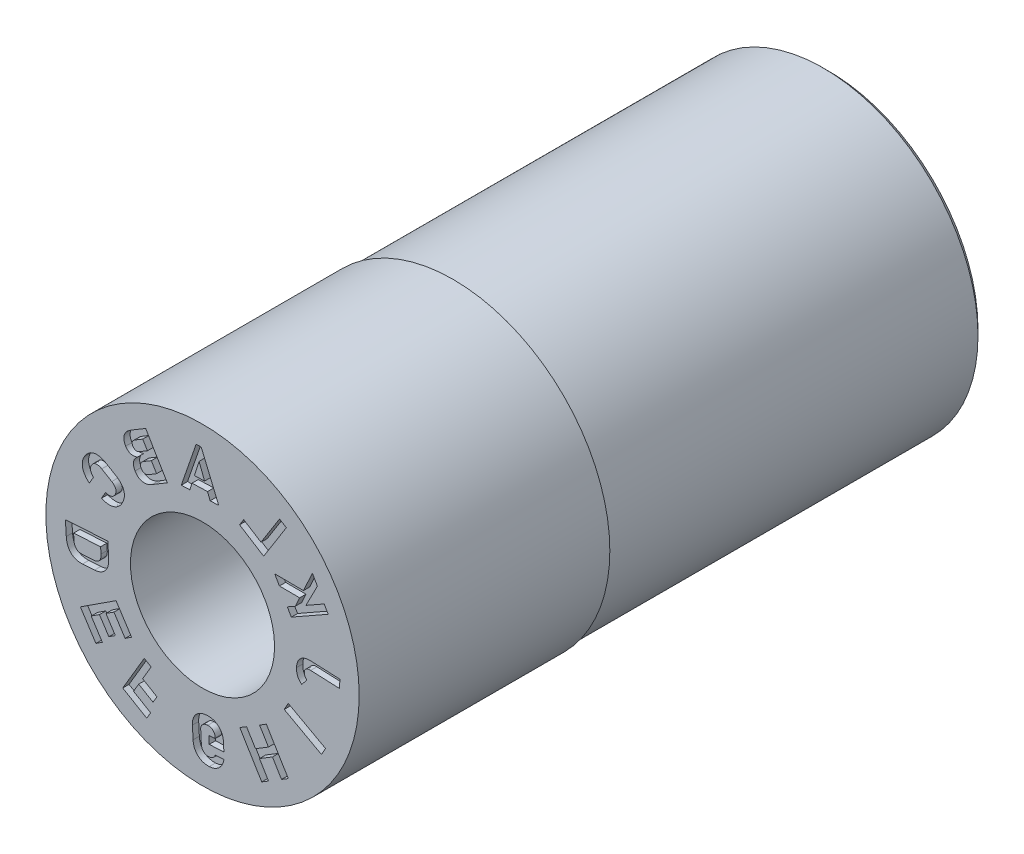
from build123d import *

# Parameters (mm, degrees)
SKETCH4_W          = 12
SKETCH4_H          = 1
CUT_EXTRUDE1_DEPTH = 0.2
CUT_EXTRUDE2_DEPTH = 2


with BuildPart() as part:
    # Sketch1 → Revolve1 (revolve)
    with BuildSketch(Plane(origin=(0, 0, 0), x_dir=(0, 0, -1), z_dir=(1, 0, 0)), mode=Mode.PRIVATE) as revolve1_sk:
        Polygon((0, 5), (0, 2.3), (4, 2.3), (4, 1.25), (16, 1.25), (16, 2.5), (20, 2.5), (20, 4.75), (19.75, 5), align=None)
    revolve(revolve1_sk.sketch.rotate(Axis((0, 0, 3.797909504), (0, 0, -1)), 90), axis=Axis((0, 0, 3.797909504), (0, 0, -1)))

    # Sketch4 → Cut-Revolve1 (revolve, cut)
    with BuildSketch(Plane(origin=(0, 0, 0), x_dir=(0, 0, -1), z_dir=(1, 0, 0)), mode=Mode.PRIVATE) as cut_revolve1_sk:
        with Locations((14, 5.435)):
            Rectangle(SKETCH4_W, SKETCH4_H)
    revolve(cut_revolve1_sk.sketch.rotate(Axis((0, 0, 0), (0, 0, -1)), 90), axis=Axis((0, 0, 0), (0, 0, -1)), mode=Mode.SUBTRACT)

    # Sketch2 → Cut-Extrude1 (cut)
    # profile 1 of 12: a face of its own
    with BuildSketch(Plane.XY):
        Polygon((3.30133436, 1.640264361), (3.666537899, 2.354151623), (3.508067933, 2.633202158), (3.220401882, 2.00838881), (2.304251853, 2.015537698), (2.453311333, 1.752407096), (3.101234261, 1.749555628), (2.962387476, 1.447979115), (2.70792278, 1.303620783), (2.833715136, 1.082062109), (4.009677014, 1.749187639), (3.883884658, 1.970746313), align=None)
    # profile 2 of 12: a face of its own
    with BuildSketch(Plane.XY):
        Polygon((2.674849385, 3.472904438), (2.458510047, 3.609103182), (1.866776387, 2.669286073), (1.313670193, 3.017419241), (1.182380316, 2.808827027), (1.951862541, 2.324625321), align=None)
    # profile 3 of 12: a face of its own
    with BuildSketch(Plane.XY):
        Polygon((-0.042748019, 4.346046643), (-0.204425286, 4.340760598), (-0.677793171, 2.972522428), (-0.403460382, 2.981399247), (-0.334589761, 3.200453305), (0.16055951, 3.21652421), (0.24353801, 3.002282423), (0.517595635, 3.011145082), align=None)
        Polygon((-0.109950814, 3.914953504), (0.066589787, 3.459144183), (-0.256554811, 3.448655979), align=None, mode=Mode.SUBTRACT)
    # profile 4 of 12: a face of its own
    with BuildSketch(Plane.XY):
        Polygon((-3.082276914, -1.775058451), (-2.826904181, -1.609171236), (-2.470700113, -2.157327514), (-2.26397346, -2.022961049), (-2.759498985, -1.259987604), (-3.898384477, -1.999794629), (-3.402858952, -2.762768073), (-3.196132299, -2.628401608), (-3.552263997, -2.080356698), (-3.289039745, -1.909369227), (-2.988825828, -2.371492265), (-2.782099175, -2.2371258), align=None)
    # profile 5 of 12: a face of its own
    with BuildSketch(Plane.XY):
        with BuildLine():
            Line((-2.170598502, 3.759586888), (-2.286163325, 3.690418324))
            add(Edge.make_bspline(
                [(-2.286163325, 3.690418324), (-2.320935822, 3.669517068), (-2.369336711, 3.63527044), (-2.423568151, 3.581302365), (-2.45572292, 3.539807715), (-2.481033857, 3.496598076), (-2.499164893, 3.451858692), (-2.510025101, 3.405746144), (-2.51313318, 3.358434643), (-2.509292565, 3.310289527), (-2.493373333, 3.243663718), (-2.470940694, 3.195922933), (-2.452625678, 3.165163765)],
                knots=[0, 0, 0, 0, 0.194845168, 0.282877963, 0.366288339, 0.446088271, 0.522464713, 0.597117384, 0.672448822, 0.749099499, 0.828057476, 1, 1, 1, 1], degree=3))
            add(Edge.make_bspline(
                [(-2.452625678, 3.165163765), (-2.439318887, 3.144239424), (-2.41826532, 3.113768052), (-2.382461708, 3.081447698), (-2.354615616, 3.061132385), (-2.324694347, 3.044996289), (-2.293150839, 3.032792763), (-2.259778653, 3.025473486), (-2.225085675, 3.021726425), (-2.189054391, 3.022551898), (-2.138248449, 3.029028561), (-2.100751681, 3.041189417), (-2.075727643, 3.050350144)],
                knots=[0, 0, 0, 0, 0.172363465, 0.253470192, 0.332877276, 0.410440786, 0.488121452, 0.566191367, 0.646247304, 0.729123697, 0.815081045, 1, 1, 1, 1], degree=3))
            add(Edge.make_bspline(
                [(-2.075727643, 3.050350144), (-2.097940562, 3.032740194), (-2.128281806, 3.003964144), (-2.160449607, 2.959963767), (-2.179347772, 2.926338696), (-2.193754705, 2.891474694), (-2.202594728, 2.855507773), (-2.207195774, 2.818881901), (-2.205957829, 2.781593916), (-2.20024065, 2.743889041), (-2.185203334, 2.692154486), (-2.167913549, 2.654610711), (-2.153058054, 2.630741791)],
                knots=[0, 0, 0, 0, 0.180211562, 0.263728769, 0.34541809, 0.424739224, 0.502578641, 0.580049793, 0.658505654, 0.738799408, 0.821729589, 1, 1, 1, 1], degree=3))
            Line((-2.153058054, 2.630741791), (-2.151552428, 2.628337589))
            add(Edge.make_bspline(
                [(-2.151552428, 2.628337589), (-2.132784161, 2.597601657), (-2.101427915, 2.554555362), (-2.04964288, 2.508804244), (-2.008730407, 2.482398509), (-1.965223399, 2.462764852), (-1.919273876, 2.450131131), (-1.871003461, 2.444897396), (-1.820780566, 2.447207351), (-1.768992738, 2.456414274), (-1.695660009, 2.478659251), (-1.642526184, 2.505210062), (-1.607777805, 2.526237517)],
                knots=[0, 0, 0, 0, 0.172311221, 0.251802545, 0.328734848, 0.403983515, 0.478872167, 0.555354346, 0.634858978, 0.71814939, 0.80591975, 1, 1, 1, 1], degree=3))
            Line((-1.607777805, 2.526237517), (-1.496858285, 2.592634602))
            Line((-1.496858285, 2.592634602), (-1.122811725, 2.816589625))
            Line((-1.122811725, 2.816589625), (-1.814848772, 3.972568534))
            Line((-1.814848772, 3.972568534), (-2.170598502, 3.759586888))
        make_face()
        with BuildLine():
            Line((-1.466027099, 2.89593432), (-1.712470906, 2.748271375))
            add(Edge.make_bspline(
                [(-1.712470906, 2.748271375), (-1.734745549, 2.73507396), (-1.76914306, 2.71854411), (-1.817113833, 2.712140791), (-1.849734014, 2.714191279), (-1.880217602, 2.723627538), (-1.918271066, 2.746052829), (-1.940047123, 2.772519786), (-1.951661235, 2.792136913)],
                knots=[0, 0, 0, 0, 0.283662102, 0.406656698, 0.523425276, 0.636774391, 0.750805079, 1, 1, 1, 1], degree=3))
            Line((-1.951661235, 2.792136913), (-1.95316686, 2.794541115))
            add(Edge.make_bspline(
                [(-1.95316686, 2.794541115), (-1.961615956, 2.808127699), (-1.971240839, 2.829523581), (-1.978303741, 2.859076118), (-1.979959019, 2.880293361), (-1.978249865, 2.901056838), (-1.973974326, 2.921501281), (-1.96529619, 2.941012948), (-1.954293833, 2.960245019), (-1.939570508, 2.978261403), (-1.915962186, 3.002437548), (-1.894238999, 3.017171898), (-1.879012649, 3.026459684)],
                knots=[0, 0, 0, 0, 0.173400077, 0.25244798, 0.328746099, 0.403232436, 0.477985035, 0.554152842, 0.63391386, 0.717808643, 0.805840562, 1, 1, 1, 1], degree=3))
            Line((-1.879012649, 3.026459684), (-1.632567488, 3.17412344))
            Line((-1.632567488, 3.17412344), (-1.466027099, 2.89593432))
        make_face(mode=Mode.SUBTRACT)
        with BuildLine():
            Line((-1.758328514, 3.384194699), (-2.004786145, 3.236523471))
            add(Edge.make_bspline(
                [(-2.004786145, 3.236523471), (-2.025052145, 3.224777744), (-2.056317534, 3.209731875), (-2.100035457, 3.204640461), (-2.129911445, 3.207077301), (-2.157859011, 3.216597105), (-2.193586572, 3.237762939), (-2.213012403, 3.263907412), (-2.224551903, 3.281943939)],
                knots=[0, 0, 0, 0, 0.278278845, 0.399345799, 0.515203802, 0.628592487, 0.744511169, 1, 1, 1, 1], degree=3))
            add(Edge.make_bspline(
                [(-2.224551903, 3.281943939), (-2.234238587, 3.298918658), (-2.24609333, 3.326206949), (-2.246259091, 3.364515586), (-2.240171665, 3.391699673), (-2.227484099, 3.417790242), (-2.200985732, 3.452249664), (-2.173101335, 3.472263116), (-2.153069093, 3.484497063)],
                knots=[0, 0, 0, 0, 0.2436073, 0.354157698, 0.467407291, 0.584252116, 0.709016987, 1, 1, 1, 1], degree=3))
            Line((-2.153069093, 3.484497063), (-1.906735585, 3.632093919))
            Line((-1.906735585, 3.632093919), (-1.758328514, 3.384194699))
        make_face(mode=Mode.SUBTRACT)
    # profile 6 of 12: a face of its own
    with BuildSketch(Plane.XY):
        Polygon((-1.911742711, -2.993861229), (-1.638916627, -2.531450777), (-1.858436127, -2.402013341), (-2.545832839, -3.567075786), (-1.780787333, -4.018449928), (-1.655845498, -3.806756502), (-2.201444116, -3.484873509), (-2.036462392, -3.205247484), (-1.578751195, -3.475142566), (-1.453917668, -3.263823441), align=None)
    # profile 7 of 12: a face of its own
    with BuildSketch(Plane.XY):
        with BuildLine():
            Line((-2.760911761, 2.191796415), (-3.080589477, 2.382444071))
            add(Edge.make_bspline(
                [(-3.080589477, 2.382444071), (-3.102709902, 2.395690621), (-3.136199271, 2.413819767), (-3.181857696, 2.4339247), (-3.215176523, 2.446471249), (-3.24823945, 2.456440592), (-3.280788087, 2.464931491), (-3.313163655, 2.470169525), (-3.345073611, 2.47355879), (-3.376544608, 2.474426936), (-3.407521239, 2.473137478), (-3.437942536, 2.469745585), (-3.467606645, 2.463686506), (-3.496733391, 2.455675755), (-3.525152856, 2.445291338), (-3.553177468, 2.432861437), (-3.580325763, 2.417801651), (-3.606870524, 2.400699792), (-3.632658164, 2.381541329), (-3.65746077, 2.360011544), (-3.681235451, 2.336140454), (-3.7042532, 2.310340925), (-3.73421596, 2.272382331), (-3.754524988, 2.241627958), (-3.767314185, 2.220160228)],
                knots=[0, 0, 0, 0, 0.096418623, 0.142170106, 0.186461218, 0.229442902, 0.271254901, 0.31212696, 0.351940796, 0.391171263, 0.429722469, 0.467793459, 0.505489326, 0.542812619, 0.580645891, 0.618521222, 0.657328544, 0.696599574, 0.736521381, 0.777345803, 0.819284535, 0.86241413, 0.906559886, 1, 1, 1, 1], degree=3))
            add(Edge.make_bspline(
                [(-3.767314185, 2.220160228), (-3.787778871, 2.185150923), (-3.813813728, 2.130508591), (-3.832173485, 2.053362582), (-3.83817758, 1.99607745), (-3.836600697, 1.938668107), (-3.827335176, 1.881589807), (-3.810055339, 1.825208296), (-3.785331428, 1.769620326), (-3.753392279, 1.715031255), (-3.699425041, 1.642419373), (-3.649892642, 1.593515), (-3.613919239, 1.562755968)],
                knots=[0, 0, 0, 0, 0.164359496, 0.242522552, 0.319818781, 0.396757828, 0.474196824, 0.553044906, 0.634665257, 0.71980849, 0.808406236, 1, 1, 1, 1], degree=3))
            Line((-3.613919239, 1.562755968), (-3.478099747, 1.790681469))
            add(Edge.make_bspline(
                [(-3.478099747, 1.790681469), (-3.493595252, 1.805813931), (-3.51598757, 1.828778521), (-3.539437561, 1.863125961), (-3.553625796, 1.888530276), (-3.564112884, 1.914285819), (-3.572338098, 1.939850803), (-3.576197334, 1.965669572), (-3.577447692, 1.991221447), (-3.575514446, 2.016604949), (-3.567316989, 2.050201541), (-3.556905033, 2.074256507), (-3.547672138, 2.089270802)],
                knots=[0, 0, 0, 0, 0.195176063, 0.286539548, 0.373239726, 0.456219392, 0.536212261, 0.614027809, 0.690102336, 0.765907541, 0.841950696, 1, 1, 1, 1], degree=3))
            add(Edge.make_bspline(
                [(-3.547672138, 2.089270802), (-3.536404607, 2.108581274), (-3.516738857, 2.134903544), (-3.485122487, 2.163383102), (-3.460414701, 2.179987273), (-3.433917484, 2.191982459), (-3.405984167, 2.199679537), (-3.376631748, 2.203080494), (-3.345986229, 2.202297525), (-3.314490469, 2.196568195), (-3.269682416, 2.183942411), (-3.237647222, 2.167093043), (-3.216296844, 2.154891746)],
                knots=[0, 0, 0, 0, 0.174815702, 0.254583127, 0.331751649, 0.406600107, 0.480982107, 0.557388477, 0.636835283, 0.719715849, 0.807055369, 1, 1, 1, 1], degree=3))
            Line((-3.216296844, 2.154891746), (-2.896619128, 1.96424409))
            add(Edge.make_bspline(
                [(-2.896619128, 1.96424409), (-2.875467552, 1.951707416), (-2.846149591, 1.930783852), (-2.813203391, 1.898057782), (-2.793529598, 1.872898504), (-2.778284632, 1.846527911), (-2.767618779, 1.819050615), (-2.761269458, 1.790818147), (-2.759261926, 1.761770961), (-2.761915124, 1.732096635), (-2.771957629, 1.690660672), (-2.786223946, 1.66099551), (-2.797609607, 1.641755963)],
                knots=[0, 0, 0, 0, 0.192501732, 0.280291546, 0.362663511, 0.441768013, 0.517825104, 0.592476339, 0.667438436, 0.744799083, 0.824735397, 1, 1, 1, 1], degree=3))
            add(Edge.make_bspline(
                [(-2.797609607, 1.641755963), (-2.806872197, 1.626516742), (-2.822618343, 1.605033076), (-2.848882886, 1.58196522), (-2.87012214, 1.567665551), (-2.893232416, 1.556371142), (-2.917701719, 1.547274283), (-2.943991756, 1.542393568), (-2.971563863, 1.539769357), (-3.000482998, 1.540125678), (-3.041819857, 1.545373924), (-3.072691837, 1.554071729), (-3.093404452, 1.561172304)],
                knots=[0, 0, 0, 0, 0.160080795, 0.236116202, 0.312169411, 0.388723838, 0.466100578, 0.545220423, 0.627432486, 0.713976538, 0.803688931, 1, 1, 1, 1], degree=3))
            Line((-3.093404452, 1.561172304), (-3.229223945, 1.333246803))
            add(Edge.make_bspline(
                [(-3.229223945, 1.333246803), (-3.184788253, 1.316712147), (-3.118141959, 1.296412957), (-3.028520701, 1.283557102), (-2.965341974, 1.281504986), (-2.904678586, 1.285878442), (-2.847043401, 1.297571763), (-2.792571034, 1.316407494), (-2.741484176, 1.342069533), (-2.693700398, 1.37422859), (-2.635021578, 1.427487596), (-2.598542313, 1.475680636), (-2.577837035, 1.510623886)],
                knots=[0, 0, 0, 0, 0.192101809, 0.280672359, 0.365807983, 0.447541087, 0.526353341, 0.603189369, 0.680187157, 0.757177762, 0.835634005, 1, 1, 1, 1], degree=3))
            add(Edge.make_bspline(
                [(-2.577837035, 1.510623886), (-2.565156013, 1.532116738), (-2.547420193, 1.564532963), (-2.528690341, 1.609092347), (-2.51673133, 1.641553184), (-2.507341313, 1.673786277), (-2.499817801, 1.705731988), (-2.495037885, 1.737460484), (-2.492446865, 1.768926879), (-2.492369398, 1.799911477), (-2.49407622, 1.83041301), (-2.498669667, 1.860359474), (-2.505462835, 1.88976656), (-2.514374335, 1.918738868), (-2.525635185, 1.947094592), (-2.538992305, 1.975046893), (-2.555018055, 2.002180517), (-2.572978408, 2.028821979), (-2.593484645, 2.054446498), (-2.616042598, 2.079383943), (-2.640595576, 2.103596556), (-2.667380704, 2.127018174), (-2.706900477, 2.157484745), (-2.738506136, 2.178852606), (-2.760911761, 2.191796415)],
                knots=[0, 0, 0, 0, 0.093394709, 0.137866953, 0.180684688, 0.222705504, 0.263356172, 0.303339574, 0.342594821, 0.381331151, 0.419141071, 0.456735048, 0.494484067, 0.531939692, 0.569987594, 0.608497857, 0.6476809, 0.687739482, 0.728571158, 0.770310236, 0.813445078, 0.857467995, 0.903296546, 1, 1, 1, 1], degree=3))
        make_face()
    # profile 8 of 12: a face of its own
    with BuildSketch(Plane.XY):
        Polygon((2.231657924, -3.083591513), (2.521782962, -3.560041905), (2.738659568, -3.427794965), (2.036803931, -2.275190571), (1.819927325, -2.407437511), (2.104236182, -2.874336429), (1.690462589, -3.126382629), (1.406102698, -2.659399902), (1.188859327, -2.791778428), (1.890714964, -3.944382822), (2.107958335, -3.812004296), (1.817884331, -3.335637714), align=None)
    # profile 9 of 12: a face of its own
    with BuildSketch(Plane.XY):
        with BuildLine():
            Line((-3.829348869, -0.781184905), (-3.445620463, -0.756829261))
            add(Edge.make_bspline(
                [(-3.445620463, -0.756829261), (-3.422080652, -0.755167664), (-3.387211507, -0.751630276), (-3.342212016, -0.74180999), (-3.309970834, -0.733537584), (-3.279250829, -0.722725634), (-3.249610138, -0.71086584), (-3.221518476, -0.696583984), (-3.194560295, -0.680784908), (-3.168992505, -0.663163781), (-3.144875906, -0.643821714), (-3.122759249, -0.622388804), (-3.101864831, -0.599584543), (-3.082854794, -0.574731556), (-3.065713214, -0.547983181), (-3.049812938, -0.519680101), (-3.03592347, -0.489472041), (-3.023513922, -0.457733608), (-3.013214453, -0.424346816), (-3.005363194, -0.389315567), (-2.998808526, -0.352777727), (-2.99468968, -0.314584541), (-2.991970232, -0.260657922), (-2.992875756, -0.219454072), (-2.994576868, -0.191545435)],
                knots=[0, 0, 0, 0, 0.086348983, 0.127732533, 0.168294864, 0.207935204, 0.246695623, 0.284917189, 0.323011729, 0.360849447, 0.398333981, 0.435880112, 0.473322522, 0.511310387, 0.550095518, 0.589378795, 0.629886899, 0.671531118, 0.713882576, 0.757464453, 0.802693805, 0.84951751, 0.897781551, 1, 1, 1, 1], degree=3))
            Line((-2.994576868, -0.191545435), (-3.022789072, 0.255378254))
            Line((-3.022789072, 0.255378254), (-4.376455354, 0.169432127))
            Line((-4.376455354, 0.169432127), (-4.348124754, -0.278309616))
            add(Edge.make_bspline(
                [(-4.348124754, -0.278309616), (-4.346427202, -0.305560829), (-4.342240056, -0.345650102), (-4.332913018, -0.397648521), (-4.324203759, -0.434187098), (-4.314303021, -0.469248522), (-4.302148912, -0.502391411), (-4.288739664, -0.534062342), (-4.273525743, -0.563951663), (-4.256731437, -0.592040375), (-4.238334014, -0.618321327), (-4.218484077, -0.642660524), (-4.196935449, -0.665092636), (-4.174044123, -0.685709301), (-4.149381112, -0.704165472), (-4.123638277, -0.721237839), (-4.096015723, -0.73580193), (-4.067096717, -0.748654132), (-4.03687586, -0.759571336), (-4.005368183, -0.768442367), (-3.972573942, -0.775130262), (-3.938489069, -0.779515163), (-3.89064189, -0.783328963), (-3.854049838, -0.782464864), (-3.829348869, -0.781184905)],
                knots=[0, 0, 0, 0, 0.099679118, 0.146986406, 0.192764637, 0.236769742, 0.27990787, 0.321550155, 0.362266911, 0.402245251, 0.44093305, 0.479288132, 0.516785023, 0.554392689, 0.591617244, 0.629153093, 0.667043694, 0.705464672, 0.744616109, 0.784244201, 0.824865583, 0.866685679, 0.909637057, 1, 1, 1, 1], degree=3))
        make_face()
        with BuildLine():
            Line((-3.25254062, -0.015424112), (-3.239981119, -0.213699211))
            add(Edge.make_bspline(
                [(-3.239981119, -0.213699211), (-3.238587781, -0.233522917), (-3.238490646, -0.262593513), (-3.242602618, -0.300043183), (-3.247501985, -0.325761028), (-3.254497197, -0.349841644), (-3.26371881, -0.372241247), (-3.274432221, -0.393200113), (-3.287802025, -0.41203938), (-3.302540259, -0.429428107), (-3.319261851, -0.444631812), (-3.337751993, -0.457628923), (-3.357633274, -0.469061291), (-3.379556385, -0.478023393), (-3.411866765, -0.486986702), (-3.437227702, -0.491189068), (-3.454717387, -0.49199616)],
                knots=[0, 0, 0, 0, 0.149294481, 0.217742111, 0.28276918, 0.345754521, 0.405751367, 0.464545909, 0.522150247, 0.578880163, 0.635526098, 0.69138069, 0.748399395, 0.807472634, 0.868753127, 1, 1, 1, 1], degree=3))
            Line((-3.454717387, -0.49199616), (-3.853328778, -0.517392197))
            add(Edge.make_bspline(
                [(-3.853328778, -0.517392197), (-3.870795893, -0.518328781), (-3.896643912, -0.5183024), (-3.92978346, -0.512834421), (-3.952600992, -0.506601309), (-3.974066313, -0.498275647), (-3.994037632, -0.48749658), (-4.012470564, -0.474375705), (-4.029536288, -0.459283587), (-4.044707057, -0.441915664), (-4.058598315, -0.422889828), (-4.070094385, -0.401639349), (-4.080151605, -0.37870405), (-4.088503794, -0.353929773), (-4.097056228, -0.317206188), (-4.100683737, -0.288389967), (-4.1020353, -0.268584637)],
                knots=[0, 0, 0, 0, 0.13151892, 0.193026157, 0.25170786, 0.308849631, 0.365540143, 0.421640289, 0.478418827, 0.536185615, 0.594485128, 0.654943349, 0.717184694, 0.782385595, 0.850943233, 1, 1, 1, 1], degree=3))
            Line((-4.1020353, -0.268584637), (-4.114604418, -0.070157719))
            Line((-4.114604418, -0.070157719), (-3.25254062, -0.015424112))
        make_face(mode=Mode.SUBTRACT)
    # profile 10 of 12: a face of its own
    with BuildSketch(Plane.XY):
        with BuildLine():
            Line((0.682337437, -3.72161446), (0.668755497, -3.457453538))
            add(Edge.make_bspline(
                [(0.668755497, -3.457453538), (0.667855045, -3.432995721), (0.663533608, -3.397077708), (0.655201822, -3.350198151), (0.646430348, -3.316916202), (0.63661091, -3.284591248), (0.624342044, -3.253640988), (0.610303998, -3.223868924), (0.594633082, -3.195261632), (0.576985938, -3.168337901), (0.558174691, -3.142736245), (0.537542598, -3.119173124), (0.51574025, -3.096933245), (0.492006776, -3.076862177), (0.467001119, -3.058293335), (0.440574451, -3.041274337), (0.412541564, -3.026417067), (0.383287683, -3.013282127), (0.353091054, -3.001624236), (0.321667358, -2.992613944), (0.28931532, -2.985601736), (0.256041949, -2.980031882), (0.20962951, -2.976325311), (0.174282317, -2.975656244), (0.150476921, -2.977305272)],
                knots=[0, 0, 0, 0, 0.092096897, 0.136211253, 0.17928166, 0.221700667, 0.2634366, 0.30459319, 0.34567114, 0.386223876, 0.42580974, 0.465274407, 0.504135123, 0.543049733, 0.58225103, 0.621435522, 0.661363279, 0.701668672, 0.742216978, 0.783216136, 0.824693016, 0.866913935, 0.910217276, 1, 1, 1, 1], degree=3))
            add(Edge.make_bspline(
                [(0.150476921, -2.977305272), (0.126486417, -2.978200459), (0.091177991, -2.982351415), (0.045180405, -2.990777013), (0.012416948, -2.998967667), (-0.019158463, -3.00897091), (-0.049485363, -3.020844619), (-0.078897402, -3.034154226), (-0.10683706, -3.04962305), (-0.13337798, -3.066686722), (-0.158693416, -3.084756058), (-0.181796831, -3.104979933), (-0.203729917, -3.125995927), (-0.223404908, -3.149048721), (-0.241788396, -3.173110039), (-0.258617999, -3.198690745), (-0.273191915, -3.225831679), (-0.2863189, -3.254065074), (-0.297661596, -3.283290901), (-0.306470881, -3.313705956), (-0.313785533, -3.344867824), (-0.318921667, -3.377014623), (-0.3231966, -3.421793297), (-0.323109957, -3.455995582), (-0.321872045, -3.479043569)],
                knots=[0, 0, 0, 0, 0.092707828, 0.137257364, 0.180688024, 0.22316353, 0.265200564, 0.306517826, 0.347867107, 0.388513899, 0.428456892, 0.467954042, 0.507098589, 0.5457718, 0.584963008, 0.624107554, 0.663987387, 0.70393038, 0.74441716, 0.785028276, 0.826230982, 0.868081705, 0.910762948, 1, 1, 1, 1], degree=3))
            Line((-0.321872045, -3.479043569), (-0.301245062, -3.877890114))
            add(Edge.make_bspline(
                [(-0.301245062, -3.877890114), (-0.300344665, -3.902347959), (-0.29602307, -3.93826589), (-0.287691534, -3.985145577), (-0.278919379, -4.018427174), (-0.269102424, -4.050753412), (-0.256824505, -4.081698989), (-0.242855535, -4.111411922), (-0.227149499, -4.13981424), (-0.209457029, -4.166508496), (-0.190708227, -4.192046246), (-0.170193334, -4.215633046), (-0.148108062, -4.237568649), (-0.124749, -4.257973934), (-0.099470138, -4.27620217), (-0.073080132, -4.29322811), (-0.045158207, -4.308402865), (-0.015889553, -4.321560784), (0.014405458, -4.332837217), (0.045678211, -4.341869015), (0.078004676, -4.349032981), (0.1112176, -4.354416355), (0.15760824, -4.358300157), (0.192878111, -4.358851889), (0.216679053, -4.357242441)],
                knots=[0, 0, 0, 0, 0.092204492, 0.136370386, 0.17949111, 0.221959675, 0.263744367, 0.304949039, 0.345757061, 0.386050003, 0.425682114, 0.465192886, 0.503831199, 0.543041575, 0.582057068, 0.621287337, 0.66145496, 0.701807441, 0.74225055, 0.783297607, 0.824493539, 0.86709897, 0.910112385, 1, 1, 1, 1], degree=3))
            add(Edge.make_bspline(
                [(0.216679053, -4.357242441), (0.255770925, -4.355627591), (0.313414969, -4.346170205), (0.38644633, -4.321604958), (0.437621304, -4.297213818), (0.48504022, -4.267044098), (0.52855529, -4.231923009), (0.567432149, -4.191634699), (0.601573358, -4.146658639), (0.630618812, -4.097618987), (0.661799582, -4.026481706), (0.676524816, -3.969481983), (0.681935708, -3.930387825)],
                knots=[0, 0, 0, 0, 0.170672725, 0.253470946, 0.33582005, 0.417619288, 0.498386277, 0.579483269, 0.661511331, 0.744467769, 0.827803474, 1, 1, 1, 1], degree=3))
            Line((0.681935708, -3.930387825), (0.406778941, -3.944765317))
            add(Edge.make_bspline(
                [(0.406778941, -3.944765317), (0.402734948, -3.958831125), (0.395152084, -3.979710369), (0.378994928, -4.004232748), (0.36527875, -4.021457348), (0.349235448, -4.036901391), (0.331389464, -4.050287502), (0.312569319, -4.062777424), (0.291919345, -4.072557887), (0.270475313, -4.080670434), (0.241029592, -4.089323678), (0.218136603, -4.09213731), (0.202822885, -4.093108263)],
                knots=[0, 0, 0, 0, 0.163455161, 0.244228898, 0.325903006, 0.408112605, 0.491213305, 0.573954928, 0.659012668, 0.744804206, 0.829003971, 1, 1, 1, 1], degree=3))
            add(Edge.make_bspline(
                [(0.202822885, -4.093108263), (0.181468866, -4.094115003), (0.149563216, -4.092869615), (0.109478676, -4.081812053), (0.08176474, -4.070442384), (0.056448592, -4.055102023), (0.033675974, -4.03648117), (0.013947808, -4.014389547), (-0.003346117, -3.989505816), (-0.016802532, -3.961396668), (-0.031889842, -3.920291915), (-0.035661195, -3.886823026), (-0.037358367, -3.864334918)],
                knots=[0, 0, 0, 0, 0.172172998, 0.253423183, 0.332967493, 0.412052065, 0.490299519, 0.568351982, 0.649249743, 0.732830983, 0.817998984, 1, 1, 1, 1], degree=3))
            Line((-0.037358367, -3.864334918), (-0.05798535, -3.465488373))
            add(Edge.make_bspline(
                [(-0.05798535, -3.465488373), (-0.059396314, -3.445440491), (-0.057254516, -3.415719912), (-0.046961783, -3.378095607), (-0.035618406, -3.352236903), (-0.020615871, -3.328627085), (-0.002756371, -3.307144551), (0.018905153, -3.289007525), (0.0432006, -3.273272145), (0.070176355, -3.260525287), (0.110201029, -3.246938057), (0.142445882, -3.243023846), (0.164333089, -3.24143945)],
                knots=[0, 0, 0, 0, 0.169384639, 0.249139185, 0.328273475, 0.406732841, 0.484577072, 0.563070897, 0.644199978, 0.728311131, 0.814245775, 1, 1, 1, 1], degree=3))
            add(Edge.make_bspline(
                [(0.164333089, -3.24143945), (0.185962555, -3.240426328), (0.218059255, -3.241630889), (0.258723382, -3.25172443), (0.286380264, -3.262803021), (0.311607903, -3.277472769), (0.334448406, -3.295222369), (0.354020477, -3.316972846), (0.370909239, -3.341631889), (0.384332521, -3.369476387), (0.398769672, -3.411051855), (0.403032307, -3.444808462), (0.404273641, -3.467744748)],
                knots=[0, 0, 0, 0, 0.174321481, 0.255810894, 0.335716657, 0.412952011, 0.489702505, 0.567216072, 0.647166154, 0.729162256, 0.814929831, 1, 1, 1, 1], degree=3))
            Line((0.404273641, -3.467744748), (0.40561726, -3.490037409))
            Line((0.40561726, -3.490037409), (0.201231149, -3.500558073))
            Line((0.201231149, -3.500558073), (0.213817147, -3.745991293))
            Line((0.213817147, -3.745991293), (0.682337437, -3.72161446))
        make_face()
    # profile 11 of 12: a face of its own
    with BuildSketch(Plane.XY):
        Polygon((2.735826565, -1.349894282), (2.608437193, -1.581961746), (3.797369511, -2.233992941), (3.924758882, -2.001925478), align=None)
    # profile 12 of 12: a face of its own
    with BuildSketch(Plane.XY):
        with BuildLine():
            Line((3.168792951, -0.611137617), (3.329057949, -0.409356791))
            add(Edge.make_bspline(
                [(3.329057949, -0.409356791), (3.315511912, -0.398093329), (3.297404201, -0.378794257), (3.277979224, -0.349642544), (3.266187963, -0.326386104), (3.256930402, -0.302260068), (3.248749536, -0.26919626), (3.246604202, -0.243802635), (3.247577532, -0.226922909)],
                knots=[0, 0, 0, 0, 0.255231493, 0.381315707, 0.506998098, 0.632722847, 0.755324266, 1, 1, 1, 1], degree=3))
            add(Edge.make_bspline(
                [(3.247577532, -0.226922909), (3.248512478, -0.204883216), (3.255096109, -0.171770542), (3.27980387, -0.135894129), (3.30378471, -0.114239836), (3.33368022, -0.097975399), (3.383043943, -0.083121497), (3.423526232, -0.080522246), (3.451567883, -0.082047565)],
                knots=[0, 0, 0, 0, 0.235578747, 0.34493456, 0.456480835, 0.57496348, 0.702365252, 1, 1, 1, 1], degree=3))
            Line((3.451567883, -0.082047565), (4.372978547, -0.12155586))
            Line((4.372978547, -0.12155586), (4.38432804, 0.142410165))
            Line((4.38432804, 0.142410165), (3.461819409, 0.182013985))
            add(Edge.make_bspline(
                [(3.461819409, 0.182013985), (3.418190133, 0.184245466), (3.354354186, 0.180990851), (3.27351566, 0.163215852), (3.228367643, 0.146324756), (3.19492475, 0.129839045), (3.171727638, 0.115672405), (3.149412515, 0.100687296), (3.129231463, 0.083360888), (3.110068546, 0.065087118), (3.092169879, 0.045309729), (3.076059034, 0.023747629), (3.061215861, 0.000869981), (3.048111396, -0.023457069), (3.036394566, -0.049124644), (3.02641344, -0.076101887), (3.017796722, -0.104341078), (3.010836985, -0.133946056), (3.003494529, -0.175916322), (3.000492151, -0.208294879), (2.999483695, -0.230229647)],
                knots=[0, 0, 0, 0, 0.185996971, 0.270621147, 0.351640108, 0.390621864, 0.429278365, 0.467346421, 0.504967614, 0.542395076, 0.580107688, 0.618424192, 0.65692399, 0.69616986, 0.736011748, 0.777014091, 0.81860016, 0.861698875, 0.906467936, 1, 1, 1, 1], degree=3))
            add(Edge.make_bspline(
                [(2.999483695, -0.230229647), (2.997842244, -0.269708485), (3.000951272, -0.328158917), (3.018004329, -0.402799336), (3.037155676, -0.454007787), (3.06172079, -0.501228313), (3.102087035, -0.557390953), (3.1403616, -0.592285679), (3.168792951, -0.611137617)],
                knots=[0, 0, 0, 0, 0.271973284, 0.400311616, 0.52557417, 0.647267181, 0.76561072, 1, 1, 1, 1], degree=3))
        make_face()
    extrude(amount=-CUT_EXTRUDE1_DEPTH, mode=Mode.SUBTRACT)

    # Sketch3 → Cut-Extrude2 (cut)
    with BuildSketch(Plane.XY.offset(-4)):
        Polygon((0.721687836, 1.25), (-0.721687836, 1.25), (-1.443375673, 0), (-0.721687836, -1.25), (0.721687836, -1.25), (1.443375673, 0), align=None)
    extrude(amount=-CUT_EXTRUDE2_DEPTH, mode=Mode.SUBTRACT)


solid = part.part
